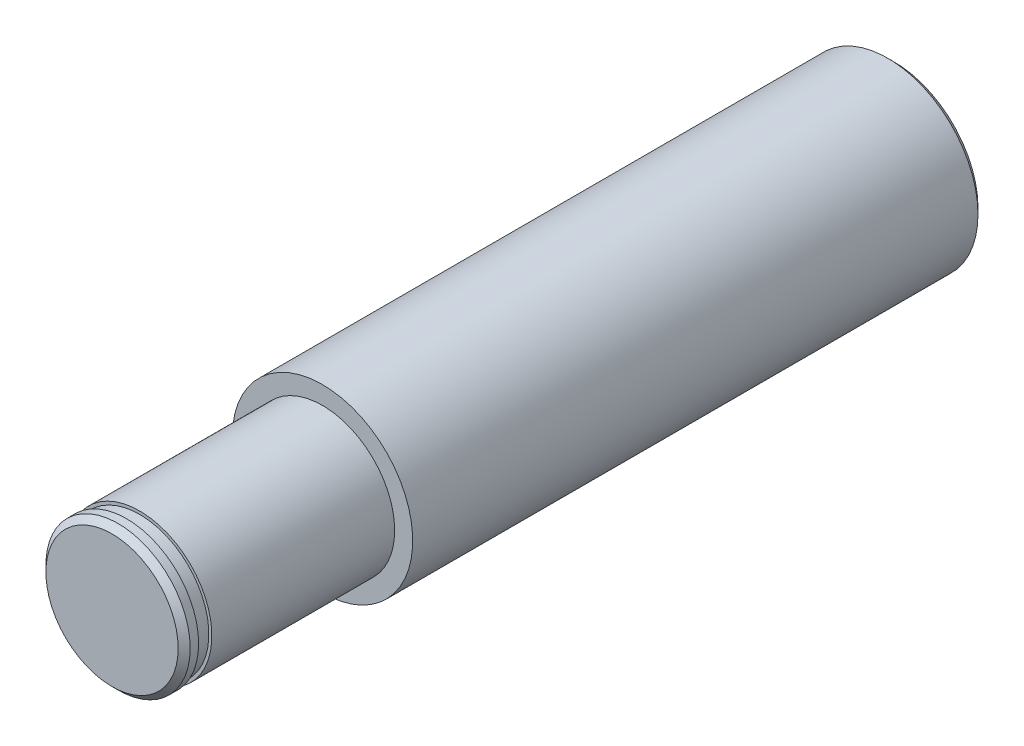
ISO-10303-21;
HEADER;
FILE_DESCRIPTION(('STEP AP214'),'2;1');
FILE_NAME('part.step','',(''),(''),'','','');
FILE_SCHEMA(('AUTOMOTIVE_DESIGN { 1 0 10303 214 1 1 1 1 }'));
ENDSEC;
DATA;
#1=APPLICATION_CONTEXT('core data for automotive mechanical design processes');
#2=APPLICATION_PROTOCOL_DEFINITION('international standard','automotive_design',2000,#1);
#3=PRODUCT_CONTEXT('',#1,'mechanical');
#4=PRODUCT('Part','Part','',(#3));
#5=PRODUCT_RELATED_PRODUCT_CATEGORY('part','',(#4));
#6=PRODUCT_DEFINITION_FORMATION('','',#4);
#7=PRODUCT_DEFINITION_CONTEXT('part definition',#1,'design');
#8=PRODUCT_DEFINITION('design','',#6,#7);
#9=PRODUCT_DEFINITION_SHAPE('','',#8);
#10=(LENGTH_UNIT() NAMED_UNIT(*) SI_UNIT(.MILLI.,.METRE.));
#11=(NAMED_UNIT(*) PLANE_ANGLE_UNIT() SI_UNIT($,.RADIAN.));
#12=(NAMED_UNIT(*) SI_UNIT($,.STERADIAN.) SOLID_ANGLE_UNIT());
#13=UNCERTAINTY_MEASURE_WITH_UNIT(LENGTH_MEASURE(1.E-05),#10,'distance_accuracy_value','');
#14=(GEOMETRIC_REPRESENTATION_CONTEXT(3) GLOBAL_UNCERTAINTY_ASSIGNED_CONTEXT((#13)) GLOBAL_UNIT_ASSIGNED_CONTEXT((#10,
#11,#12)) REPRESENTATION_CONTEXT('',''));
#15=CARTESIAN_POINT('',(0.,0.,0.));
#16=DIRECTION('',(0.,0.,1.));
#17=DIRECTION('',(1.,0.,0.));
#18=AXIS2_PLACEMENT_3D('',#15,#16,#17);
#19=CARTESIAN_POINT('',(0.,0.,65.));
#20=DIRECTION('',(0.,0.,-1.));
#21=DIRECTION('',(-1.,0.,0.));
#22=AXIS2_PLACEMENT_3D('',#19,#20,#21);
#23=CYLINDRICAL_SURFACE('',#22,7.5);
#24=CARTESIAN_POINT('',(0.,0.,47.5));
#25=DIRECTION('',(0.,0.,-1.));
#26=DIRECTION('',(-1.,0.,0.));
#27=AXIS2_PLACEMENT_3D('',#24,#25,#26);
#28=CIRCLE('',#27,7.5);
#29=CARTESIAN_POINT('',(-7.5,0.,47.5));
#30=VERTEX_POINT('',#29);
#31=EDGE_CURVE('E54',#30,#30,#28,.T.);
#32=ORIENTED_EDGE('',*,*,#31,.T.);
#33=EDGE_LOOP('',(#32));
#34=FACE_BOUND('',#33,.T.);
#35=CARTESIAN_POINT('',(0.,0.,0.5));
#36=DIRECTION('',(0.,0.,1.));
#37=DIRECTION('',(1.,0.,0.));
#38=AXIS2_PLACEMENT_3D('',#35,#36,#37);
#39=CIRCLE('',#38,7.5);
#40=CARTESIAN_POINT('',(7.5,0.,0.5));
#41=VERTEX_POINT('',#40);
#42=EDGE_CURVE('E43',#41,#41,#39,.T.);
#43=ORIENTED_EDGE('',*,*,#42,.T.);
#44=EDGE_LOOP('',(#43));
#45=FACE_BOUND('',#44,.T.);
#46=ADVANCED_FACE('F29',(#34,#45),#23,.T.);
#47=CARTESIAN_POINT('',(0.,0.,0.));
#48=DIRECTION('',(0.,0.,1.));
#49=DIRECTION('',(1.,0.,0.));
#50=AXIS2_PLACEMENT_3D('',#47,#48,#49);
#51=PLANE('',#50);
#52=CARTESIAN_POINT('',(0.,0.,0.));
#53=DIRECTION('',(0.,0.,1.));
#54=DIRECTION('',(1.,0.,0.));
#55=AXIS2_PLACEMENT_3D('',#52,#53,#54);
#56=CIRCLE('',#55,7.);
#57=CARTESIAN_POINT('',(7.,0.,0.));
#58=VERTEX_POINT('',#57);
#59=EDGE_CURVE('E39',#58,#58,#56,.F.);
#60=ORIENTED_EDGE('',*,*,#59,.T.);
#61=EDGE_LOOP('',(#60));
#62=FACE_BOUND('',#61,.T.);
#63=ADVANCED_FACE('F100',(#62),#51,.F.);
#64=CARTESIAN_POINT('',(0.,0.,0.5));
#65=DIRECTION('',(0.,0.,1.));
#66=DIRECTION('',(1.,0.,0.));
#67=AXIS2_PLACEMENT_3D('',#64,#65,#66);
#68=CONICAL_SURFACE('',#67,7.5,0.785398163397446);
#69=ORIENTED_EDGE('',*,*,#59,.F.);
#70=EDGE_LOOP('',(#69));
#71=FACE_BOUND('',#70,.T.);
#72=ORIENTED_EDGE('',*,*,#42,.F.);
#73=EDGE_LOOP('',(#72));
#74=FACE_BOUND('',#73,.T.);
#75=ADVANCED_FACE('F105',(#71,#74),#68,.T.);
#76=CARTESIAN_POINT('',(0.,11.7146990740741,47.5));
#77=DIRECTION('',(0.,0.,-1.));
#78=DIRECTION('',(-1.,0.,0.));
#79=AXIS2_PLACEMENT_3D('',#76,#77,#78);
#80=PLANE('',#79);
#81=CARTESIAN_POINT('',(0.,0.,47.5));
#82=DIRECTION('',(0.,0.,-1.));
#83=DIRECTION('',(-1.,0.,0.));
#84=AXIS2_PLACEMENT_3D('',#81,#82,#83);
#85=CIRCLE('',#84,6.);
#86=CARTESIAN_POINT('',(-6.,0.,47.5));
#87=VERTEX_POINT('',#86);
#88=EDGE_CURVE('E49',#87,#87,#85,.T.);
#89=ORIENTED_EDGE('',*,*,#88,.T.);
#90=EDGE_LOOP('',(#89));
#91=FACE_BOUND('',#90,.T.);
#92=ORIENTED_EDGE('',*,*,#31,.F.);
#93=EDGE_LOOP('',(#92));
#94=FACE_BOUND('',#93,.T.);
#95=ADVANCED_FACE('F97',(#91,#94),#80,.F.);
#96=CARTESIAN_POINT('',(0.,0.,0.));
#97=DIRECTION('',(0.,0.,-1.));
#98=DIRECTION('',(-1.,0.,0.));
#99=AXIS2_PLACEMENT_3D('',#96,#97,#98);
#100=CYLINDRICAL_SURFACE('',#99,6.);
#101=CARTESIAN_POINT('',(0.,0.,62.7));
#102=DIRECTION('',(0.,0.,-1.));
#103=DIRECTION('',(-1.,0.,0.));
#104=AXIS2_PLACEMENT_3D('',#101,#102,#103);
#105=CIRCLE('',#104,6.);
#106=CARTESIAN_POINT('',(-6.00000000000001,0.,62.7));
#107=VERTEX_POINT('',#106);
#108=EDGE_CURVE('E50',#107,#107,#105,.T.);
#109=ORIENTED_EDGE('',*,*,#108,.T.);
#110=EDGE_LOOP('',(#109));
#111=FACE_BOUND('',#110,.T.);
#112=ORIENTED_EDGE('',*,*,#88,.F.);
#113=EDGE_LOOP('',(#112));
#114=FACE_BOUND('',#113,.T.);
#115=ADVANCED_FACE('F80',(#111,#114),#100,.T.);
#116=CARTESIAN_POINT('',(0.,9.99999999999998,63.8));
#117=DIRECTION('',(0.,0.,1.));
#118=DIRECTION('',(1.,0.,0.));
#119=AXIS2_PLACEMENT_3D('',#116,#117,#118);
#120=PLANE('',#119);
#121=CARTESIAN_POINT('',(0.,0.,63.8));
#122=DIRECTION('',(0.,0.,-1.));
#123=DIRECTION('',(-1.,0.,0.));
#124=AXIS2_PLACEMENT_3D('',#121,#122,#123);
#125=CIRCLE('',#124,5.74999999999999);
#126=CARTESIAN_POINT('',(-5.75,0.,63.8));
#127=VERTEX_POINT('',#126);
#128=EDGE_CURVE('E53',#127,#127,#125,.T.);
#129=ORIENTED_EDGE('',*,*,#128,.F.);
#130=EDGE_LOOP('',(#129));
#131=FACE_BOUND('',#130,.T.);
#132=CARTESIAN_POINT('',(0.,0.,63.8));
#133=DIRECTION('',(0.,0.,1.));
#134=DIRECTION('',(1.,0.,0.));
#135=AXIS2_PLACEMENT_3D('',#132,#133,#134);
#136=CIRCLE('',#135,6.);
#137=CARTESIAN_POINT('',(5.99999999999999,0.,63.8));
#138=VERTEX_POINT('',#137);
#139=EDGE_CURVE('E46',#138,#138,#136,.T.);
#140=ORIENTED_EDGE('',*,*,#139,.F.);
#141=EDGE_LOOP('',(#140));
#142=FACE_BOUND('',#141,.T.);
#143=ADVANCED_FACE('F77',(#131,#142),#120,.F.);
#144=CARTESIAN_POINT('',(0.,10.,62.7));
#145=DIRECTION('',(0.,0.,-1.));
#146=DIRECTION('',(-1.,0.,0.));
#147=AXIS2_PLACEMENT_3D('',#144,#145,#146);
#148=PLANE('',#147);
#149=CARTESIAN_POINT('',(0.,0.,62.7));
#150=DIRECTION('',(0.,0.,-1.));
#151=DIRECTION('',(-1.,0.,0.));
#152=AXIS2_PLACEMENT_3D('',#149,#150,#151);
#153=CIRCLE('',#152,5.74999999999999);
#154=CARTESIAN_POINT('',(-5.75,0.,62.7));
#155=VERTEX_POINT('',#154);
#156=EDGE_CURVE('E63',#155,#155,#153,.T.);
#157=ORIENTED_EDGE('',*,*,#156,.T.);
#158=EDGE_LOOP('',(#157));
#159=FACE_BOUND('',#158,.T.);
#160=ORIENTED_EDGE('',*,*,#108,.F.);
#161=EDGE_LOOP('',(#160));
#162=FACE_BOUND('',#161,.T.);
#163=ADVANCED_FACE('F67',(#159,#162),#148,.F.);
#164=CARTESIAN_POINT('',(0.,0.,0.));
#165=DIRECTION('',(0.,0.,-1.));
#166=DIRECTION('',(-1.,0.,0.));
#167=AXIS2_PLACEMENT_3D('',#164,#165,#166);
#168=CYLINDRICAL_SURFACE('',#167,5.74999999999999);
#169=ORIENTED_EDGE('',*,*,#156,.F.);
#170=EDGE_LOOP('',(#169));
#171=FACE_BOUND('',#170,.T.);
#172=ORIENTED_EDGE('',*,*,#128,.T.);
#173=EDGE_LOOP('',(#172));
#174=FACE_BOUND('',#173,.T.);
#175=ADVANCED_FACE('F70',(#171,#174),#168,.T.);
#176=CARTESIAN_POINT('',(0.,0.,65.));
#177=DIRECTION('',(0.,0.,1.));
#178=DIRECTION('',(1.,0.,0.));
#179=AXIS2_PLACEMENT_3D('',#176,#177,#178);
#180=PLANE('',#179);
#181=CARTESIAN_POINT('',(0.,0.,65.));
#182=DIRECTION('',(0.,0.,1.));
#183=DIRECTION('',(1.,0.,0.));
#184=AXIS2_PLACEMENT_3D('',#181,#182,#183);
#185=CIRCLE('',#184,5.5);
#186=CARTESIAN_POINT('',(5.49999999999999,0.,65.));
#187=VERTEX_POINT('',#186);
#188=EDGE_CURVE('E10',#187,#187,#185,.T.);
#189=ORIENTED_EDGE('',*,*,#188,.T.);
#190=EDGE_LOOP('',(#189));
#191=FACE_BOUND('',#190,.T.);
#192=ADVANCED_FACE('F73',(#191),#180,.T.);
#193=CARTESIAN_POINT('',(0.,0.,64.5));
#194=DIRECTION('',(0.,0.,1.));
#195=DIRECTION('',(1.,0.,0.));
#196=AXIS2_PLACEMENT_3D('',#193,#194,#195);
#197=CIRCLE('',#196,6.);
#198=CARTESIAN_POINT('',(5.99999999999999,0.,64.5));
#199=VERTEX_POINT('',#198);
#200=EDGE_CURVE('E35',#199,#199,#197,.F.);
#201=ORIENTED_EDGE('',*,*,#200,.T.);
#202=EDGE_LOOP('',(#201));
#203=FACE_BOUND('',#202,.T.);
#204=ORIENTED_EDGE('',*,*,#139,.T.);
#205=EDGE_LOOP('',(#204));
#206=FACE_BOUND('',#205,.T.);
#207=ADVANCED_FACE('F84',(#203,#206),#100,.T.);
#208=CARTESIAN_POINT('',(0.,0.,64.5));
#209=DIRECTION('',(0.,0.,-1.));
#210=DIRECTION('',(-1.,0.,0.));
#211=AXIS2_PLACEMENT_3D('',#208,#209,#210);
#212=CONICAL_SURFACE('',#211,6.,0.785398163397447);
#213=ORIENTED_EDGE('',*,*,#188,.F.);
#214=EDGE_LOOP('',(#213));
#215=FACE_BOUND('',#214,.T.);
#216=ORIENTED_EDGE('',*,*,#200,.F.);
#217=EDGE_LOOP('',(#216));
#218=FACE_BOUND('',#217,.T.);
#219=ADVANCED_FACE('F86',(#215,#218),#212,.T.);
#220=CLOSED_SHELL('',(#46,#63,#75,#95,#115,#143,#163,#175,#192,#207,#219));
#221=MANIFOLD_SOLID_BREP('B2',#220);
#222=ADVANCED_BREP_SHAPE_REPRESENTATION('',(#18,#221),#14);
#223=SHAPE_DEFINITION_REPRESENTATION(#9,#222);
ENDSEC;
END-ISO-10303-21;
